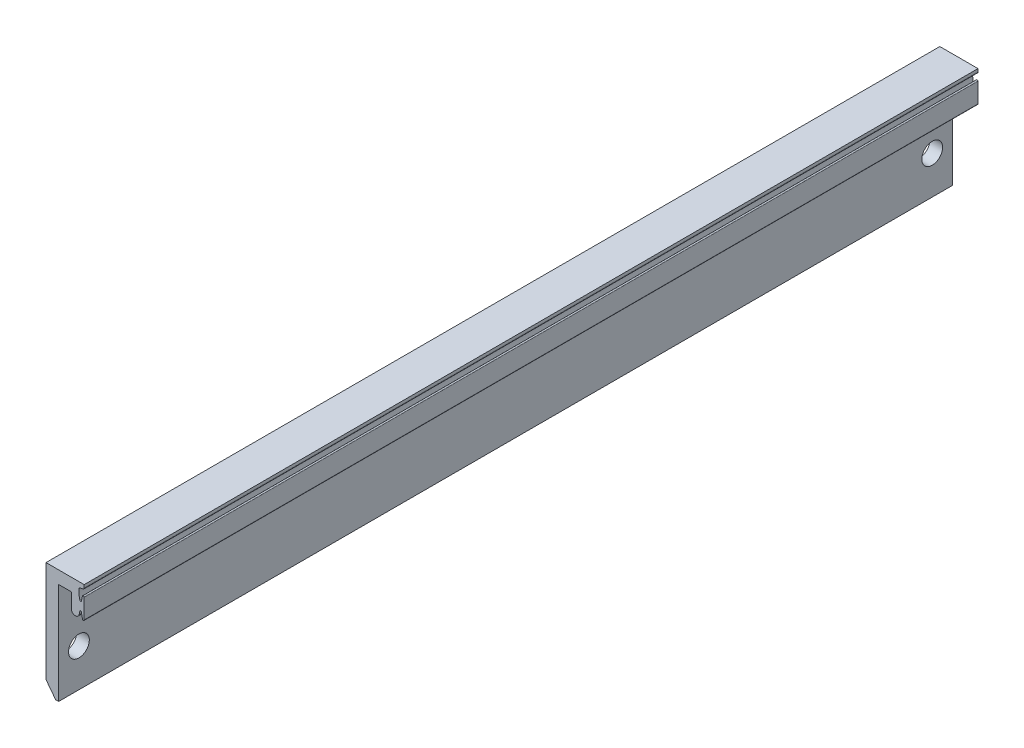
from build123d import *

# Parameters (mm, degrees)
EXTRUDE_1_DEPTH     = 88.225
SKETCH_2_R          = 2.05
CUT_EXTRUDE_1_DEPTH = 3260.580015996


with BuildPart() as part:
    # Sketch 1 → Extrude 1 (new, symmetric)
    with BuildSketch(Plane.XY):
        with BuildLine():
            Line((2475.892586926, -3235.877107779), (2468.352586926, -3235.877107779))
            Line((2468.352586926, -3235.877107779), (2468.352586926, -3255.877107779))
            Line((2468.352586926, -3255.877107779), (2470.252586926, -3258.377107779))
            Line((2470.252586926, -3258.377107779), (2470.852586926, -3258.377107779))
            Line((2470.852586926, -3258.377107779), (2470.852586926, -3238.377107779))
            Line((2470.852586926, -3238.377107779), (2473.352586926, -3238.377107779))
            Line((2473.352586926, -3238.377107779), (2473.352586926, -3241.243397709))
            Line((2473.352586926, -3241.243397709), (2473.352586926, -3241.293845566))
            ThreePointArc((2473.352586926, -3241.293845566), (2474.054120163, -3242.072633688), (2474.901701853, -3241.455977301))
            Line((2474.901701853, -3241.455977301), (2475.034328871, -3240.829314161))
            ThreePointArc((2475.034328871, -3240.829314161), (2475.03583749, -3240.821049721), (2475.037806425, -3240.812882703))
            ThreePointArc((2475.037806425, -3240.812882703), (2475.187472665, -3240.702187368), (2475.32961412, -3240.82239239))
            Line((2475.32961412, -3240.82239239), (2475.555828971, -3241.941668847))
            ThreePointArc((2475.555828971, -3241.941668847), (2475.742824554, -3242.076887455), (2475.892586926, -3241.901323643))
            Line((2475.892586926, -3241.901323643), (2475.892586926, -3241.864607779))
            Line((2475.892586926, -3241.864607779), (2475.892586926, -3238.052891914))
            Line((2475.892586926, -3238.052891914), (2475.892586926, -3238.039607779))
            ThreePointArc((2475.892586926, -3238.039607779), (2475.738732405, -3237.876887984), (2475.556904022, -3238.007606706))
            Line((2475.556904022, -3238.007606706), (2475.328666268, -3238.986178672))
            ThreePointArc((2475.328666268, -3238.986178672), (2475.174172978, -3239.101871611), (2475.03361058, -3238.969602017))
            ThreePointArc((2475.03361058, -3238.969602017), (2474.869641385, -3238.052288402), (2474.839643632, -3237.120918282))
            ThreePointArc((2474.839643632, -3237.120918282), (2474.914894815, -3236.933969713), (2475.091454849, -3236.836814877))
            Line((2475.091454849, -3236.836814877), (2475.640533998, -3236.747916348))
            ThreePointArc((2475.640533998, -3236.747916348), (2475.821042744, -3236.646215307), (2475.892586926, -3236.45177267))
            Line((2475.892586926, -3236.45177267), (2475.892586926, -3235.877107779))
        make_face()
    extrude(amount=EXTRUDE_1_DEPTH, both=True)

    # Sketch 2 → Cut-Extrude 1 (cut, through all)
    with BuildSketch(Plane.ZY.offset(-2468.352586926)):
        with Locations(Location((-84.225, -3250.877107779, 0), (0, 0, 270))):
            Circle(SKETCH_2_R)
        with Locations(Location((84.225, -3250.877107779, 0), (0, 0, 90))):
            Circle(SKETCH_2_R)
    extrude(amount=-CUT_EXTRUDE_1_DEPTH, mode=Mode.SUBTRACT)


solid = part.part
